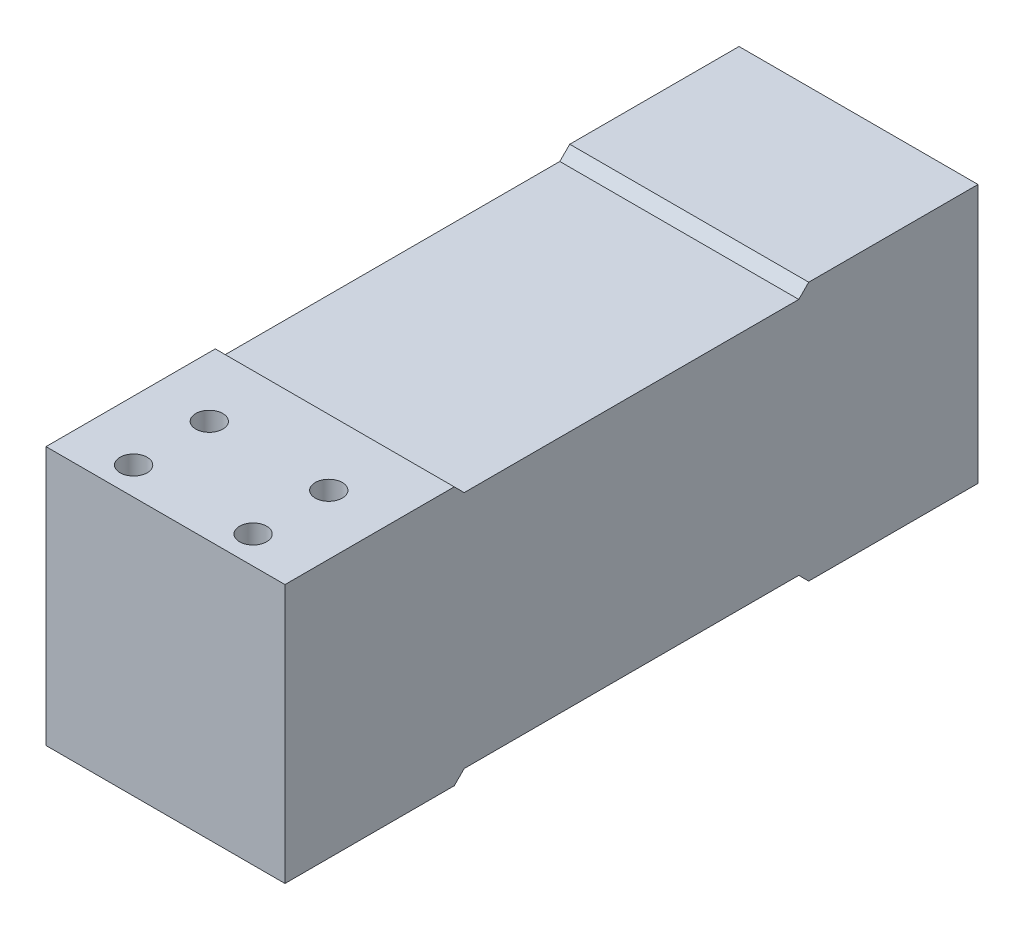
from build123d import *

# Parameters (mm, degrees)
EXTRUDE1_DEPTH       = 30
LPATTERN1_COUNT      = 2
LPATTERN1_PITCH      = 30
LPATTERN1_COUNT_DIR2 = 2
LPATTERN1_PITCH_DIR2 = 19
LPATTERN2_COUNT      = 2
LPATTERN2_PITCH      = 30
LPATTERN2_COUNT_DIR2 = 2
LPATTERN2_PITCH_DIR2 = 19


with BuildPart() as part:
    # Sketch1 → Extrude1 (new, symmetric)
    with BuildSketch(Plane(origin=(0, 0, 0), x_dir=(0, 0, -1), z_dir=(1, 0, 0))):
        Polygon((0, 0), (42.5, 0), (45, 2.5), (129, 2.5), (131.5, 0), (174, 0), (174, 65), (131.5, 65), (129, 62.5), (45, 62.5), (42.5, 65), (0, 65), align=None)
    extrude(amount=EXTRUDE1_DEPTH, both=True)

    # Sketch3 → M8 Tapped Hole1 (revolve, cut)
    with BuildSketch(Plane(origin=(-15, 65, -7), x_dir=(0, 0, 1), z_dir=(1, 0, 0))):
        Polygon((0, 0), (0, 27.042926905), (3.4, 25.0000008), (3.4, 0), align=None)
    m8_tapped_hole1 = revolve(axis=Axis((-15, 71.35, -7), (0, -1, 0)), mode=Mode.SUBTRACT)

    # LPattern1: M8 Tapped Hole1 2 × 2
    with Locations(*[(i * LPATTERN1_PITCH, 0, -j * LPATTERN1_PITCH_DIR2) for i in range(LPATTERN1_COUNT) for j in range(LPATTERN1_COUNT_DIR2) if (i, j) != (0, 0)]):
        add(m8_tapped_hole1, mode=Mode.SUBTRACT)

    # Sketch5 → M8 Tapped Hole2 (revolve, cut)
    with BuildSketch(Plane(origin=(-15, 0, -167), x_dir=(0, 0, -1), z_dir=(1, 0, 0))):
        Polygon((0, 0), (0, 27.042926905), (3.4, 25.0000008), (3.4, 0), align=None)
    m8_tapped_hole2 = revolve(axis=Axis((-15, -6.35, -167), (0, 1, 0)), mode=Mode.SUBTRACT)

    # LPattern2: M8 Tapped Hole2 2 × 2
    with Locations(*[(i * LPATTERN2_PITCH, 0, j * LPATTERN2_PITCH_DIR2) for i in range(LPATTERN2_COUNT) for j in range(LPATTERN2_COUNT_DIR2) if (i, j) != (0, 0)]):
        add(m8_tapped_hole2, mode=Mode.SUBTRACT)


solid = part.part
